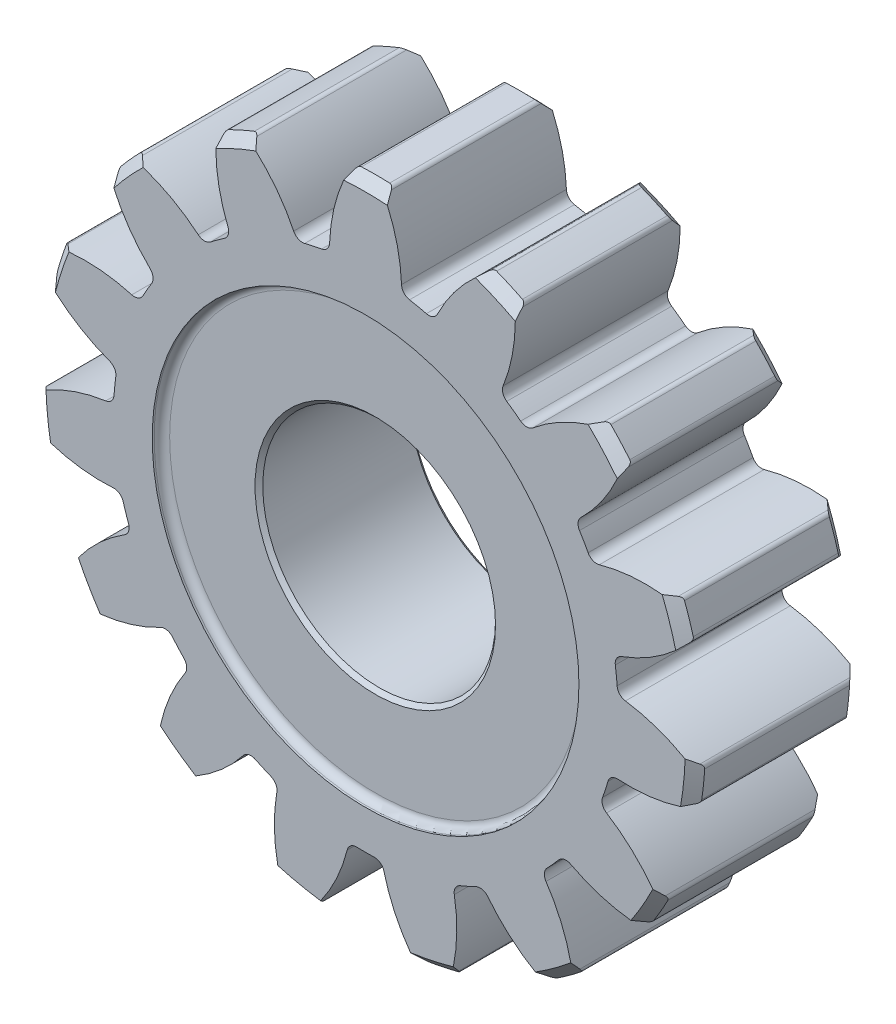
from build123d import *

# Parameters (mm, degrees)
ESQUISSE1_R                  = 13
ESQUISSE1_R_2                = 6
BASE_EXTRUSION_DEPTH         = 8.5
BOSS_EXTRU_2_DEPTH           = 8.5
R_P_TITION_CIRCULAIRE1_COUNT = 15
ESQUISSE4_R                  = 11
EXTRUSION1_DEPTH             = 0.5
CHANFREIN1_SIZE              = 0.2
CONG_1_R                     = 0.4


with BuildPart() as part:
    # Esquisse1 → Base-Extrusion (new body)
    with BuildSketch(Plane.XY):
        Circle(ESQUISSE1_R)
        Circle(ESQUISSE1_R_2, mode=Mode.SUBTRACT)
    extrude(amount=BASE_EXTRUSION_DEPTH)

    # Esquisse2 → Boss.-Extru.2 (add, through all)
    with BuildSketch(Plane.XY.offset(8.5)):
        with BuildLine():
            ThreePointArc((0.727172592, 16.984440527), (0, 17), (-0.727172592, 16.984440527))
            ThreePointArc((-0.727172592, 16.984440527), (-0.852355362, 16.944520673), (-0.940005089, 16.846633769))
            ThreePointArc((-0.940005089, 16.846633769), (-1.588767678, 15.109765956), (-1.8542706, 13.274797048))
            ThreePointArc((-1.8542706, 13.274797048), (-1.976768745, 12.964944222), (-2.266749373, 12.800853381))
            ThreePointArc((-2.266749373, 12.800853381), (0, 13), (2.266749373, 12.800853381))
            ThreePointArc((2.266749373, 12.800853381), (1.976768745, 12.964944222), (1.8542706, 13.274797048))
            ThreePointArc((1.8542706, 13.274797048), (1.588767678, 15.109765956), (0.940005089, 16.846633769))
            ThreePointArc((0.940005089, 16.846633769), (0.852355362, 16.944520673), (0.727172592, 16.984440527))
        make_face()
    boss_extru_2 = extrude(amount=-BOSS_EXTRU_2_DEPTH)

    # R_p_tition circulaire1: Boss.-Extru.2 ×15 about axis
    r_p_tition_circulaire1_axis = Axis((0, 0, 0), (0, 0, 1))
    for i in range(1, R_P_TITION_CIRCULAIRE1_COUNT):
        add(boss_extru_2.rotate(r_p_tition_circulaire1_axis, i * 360 / R_P_TITION_CIRCULAIRE1_COUNT))

    # Esquisse3 → Enl_vement de mati_re-R_volution1 (revolve, cut)
    with BuildSketch(Plane(origin=(0, 0, 0), x_dir=(0, 0, -1), z_dir=(1, 0, 0))):
        Polygon((-9.166075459, 15.818365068), (-7.518481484, 17.465959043), (-9.166075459, 17.465959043), align=None)
        Polygon((0.351646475, 16.132794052), (-0.981518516, 17.465959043), (0.351646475, 17.465959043), align=None)
    revolve(axis=Axis((0, 0, 0), (0, 0, 1)), mode=Mode.SUBTRACT)

    # Esquisse4 → Extrusion1 (cut)
    with BuildSketch(Plane.XY.offset(8.5)):
        Circle(ESQUISSE4_R)
    extrude(amount=-EXTRUSION1_DEPTH, mode=Mode.SUBTRACT)

    # Chanfrein1
    chanfrein1_edges = [part.edges().sort_by_distance(p)[0] for p in [
        (-6, 0, 0),
        (-6, 0, 8),
    ]]
    chamfer(chanfrein1_edges, length=CHANFREIN1_SIZE)

    # Cong_1
    cong_1_edges = [part.edges().sort_by_distance(p)[0] for p in [
        (-11, 0, 8),
    ]]
    fillet(cong_1_edges, radius=CONG_1_R)


solid = part.part
